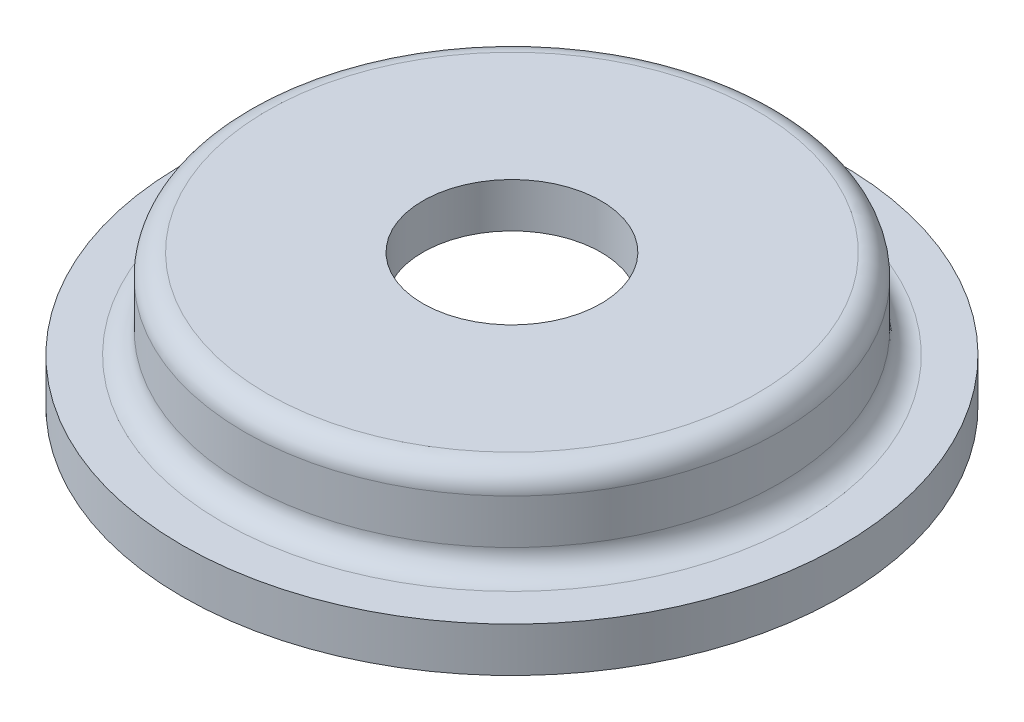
ISO-10303-21;
HEADER;
FILE_DESCRIPTION(('STEP AP214'),'2;1');
FILE_NAME('part.step','',(''),(''),'','','');
FILE_SCHEMA(('AUTOMOTIVE_DESIGN { 1 0 10303 214 1 1 1 1 }'));
ENDSEC;
DATA;
#1=APPLICATION_CONTEXT('core data for automotive mechanical design processes');
#2=APPLICATION_PROTOCOL_DEFINITION('international standard','automotive_design',2000,#1);
#3=PRODUCT_CONTEXT('',#1,'mechanical');
#4=PRODUCT('Part','Part','',(#3));
#5=PRODUCT_RELATED_PRODUCT_CATEGORY('part','',(#4));
#6=PRODUCT_DEFINITION_FORMATION('','',#4);
#7=PRODUCT_DEFINITION_CONTEXT('part definition',#1,'design');
#8=PRODUCT_DEFINITION('design','',#6,#7);
#9=PRODUCT_DEFINITION_SHAPE('','',#8);
#10=(LENGTH_UNIT() NAMED_UNIT(*) SI_UNIT(.MILLI.,.METRE.));
#11=(NAMED_UNIT(*) PLANE_ANGLE_UNIT() SI_UNIT($,.RADIAN.));
#12=(NAMED_UNIT(*) SI_UNIT($,.STERADIAN.) SOLID_ANGLE_UNIT());
#13=UNCERTAINTY_MEASURE_WITH_UNIT(LENGTH_MEASURE(1.E-05),#10,'distance_accuracy_value','');
#14=(GEOMETRIC_REPRESENTATION_CONTEXT(3) GLOBAL_UNCERTAINTY_ASSIGNED_CONTEXT((#13)) GLOBAL_UNIT_ASSIGNED_CONTEXT((#10,
#11,#12)) REPRESENTATION_CONTEXT('',''));
#15=CARTESIAN_POINT('',(0.,0.,0.));
#16=DIRECTION('',(0.,0.,1.));
#17=DIRECTION('',(1.,0.,0.));
#18=AXIS2_PLACEMENT_3D('',#15,#16,#17);
#19=CARTESIAN_POINT('',(-7.4,0.,0.));
#20=DIRECTION('',(0.,-1.,0.));
#21=DIRECTION('',(0.,0.,-1.));
#22=AXIS2_PLACEMENT_3D('',#19,#20,#21);
#23=PLANE('',#22);
#24=CARTESIAN_POINT('',(0.,0.,0.));
#25=DIRECTION('',(0.,1.,0.));
#26=DIRECTION('',(0.,0.,1.));
#27=AXIS2_PLACEMENT_3D('',#24,#25,#26);
#28=CIRCLE('',#27,5.5);
#29=CARTESIAN_POINT('',(0.,0.,5.5));
#30=VERTEX_POINT('',#29);
#31=EDGE_CURVE('E10',#30,#30,#28,.T.);
#32=ORIENTED_EDGE('',*,*,#31,.T.);
#33=EDGE_LOOP('',(#32));
#34=FACE_BOUND('',#33,.T.);
#35=CARTESIAN_POINT('',(0.,0.,0.));
#36=DIRECTION('',(0.,1.,0.));
#37=DIRECTION('',(0.,0.,1.));
#38=AXIS2_PLACEMENT_3D('',#35,#36,#37);
#39=CIRCLE('',#38,7.4);
#40=CARTESIAN_POINT('',(0.,0.,7.4));
#41=VERTEX_POINT('',#40);
#42=EDGE_CURVE('E71',#41,#41,#39,.T.);
#43=ORIENTED_EDGE('',*,*,#42,.F.);
#44=EDGE_LOOP('',(#43));
#45=FACE_BOUND('',#44,.T.);
#46=ADVANCED_FACE('F31',(#34,#45),#23,.T.);
#47=CARTESIAN_POINT('',(0.,0.500000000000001,0.));
#48=DIRECTION('',(0.,1.,0.));
#49=DIRECTION('',(0.,0.,1.));
#50=AXIS2_PLACEMENT_3D('',#47,#48,#49);
#51=TOROIDAL_SURFACE('',#50,5.5,0.5);
#52=CARTESIAN_POINT('',(0.,0.500000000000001,0.));
#53=DIRECTION('',(0.,1.,0.));
#54=DIRECTION('',(0.,0.,1.));
#55=AXIS2_PLACEMENT_3D('',#52,#53,#54);
#56=CIRCLE('',#55,5.);
#57=CARTESIAN_POINT('',(0.,0.500000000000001,5.));
#58=VERTEX_POINT('',#57);
#59=EDGE_CURVE('E37',#58,#58,#56,.T.);
#60=ORIENTED_EDGE('',*,*,#59,.T.);
#61=EDGE_LOOP('',(#60));
#62=FACE_BOUND('',#61,.T.);
#63=ORIENTED_EDGE('',*,*,#31,.F.);
#64=EDGE_LOOP('',(#63));
#65=FACE_BOUND('',#64,.T.);
#66=ADVANCED_FACE('F79',(#62,#65),#51,.T.);
#67=CARTESIAN_POINT('',(0.,7.14478932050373,0.));
#68=DIRECTION('',(0.,1.,0.));
#69=DIRECTION('',(0.,0.,1.));
#70=AXIS2_PLACEMENT_3D('',#67,#68,#69);
#71=CYLINDRICAL_SURFACE('',#70,5.);
#72=CARTESIAN_POINT('',(0.,1.5,0.));
#73=DIRECTION('',(0.,1.,0.));
#74=DIRECTION('',(0.,0.,1.));
#75=AXIS2_PLACEMENT_3D('',#72,#73,#74);
#76=CIRCLE('',#75,5.);
#77=CARTESIAN_POINT('',(0.,1.5,5.));
#78=VERTEX_POINT('',#77);
#79=EDGE_CURVE('E41',#78,#78,#76,.T.);
#80=ORIENTED_EDGE('',*,*,#79,.T.);
#81=EDGE_LOOP('',(#80));
#82=FACE_BOUND('',#81,.T.);
#83=ORIENTED_EDGE('',*,*,#59,.F.);
#84=EDGE_LOOP('',(#83));
#85=FACE_BOUND('',#84,.T.);
#86=ADVANCED_FACE('F83',(#82,#85),#71,.F.);
#87=CARTESIAN_POINT('',(0.,1.5,0.));
#88=DIRECTION('',(0.,1.,0.));
#89=DIRECTION('',(0.,0.,1.));
#90=AXIS2_PLACEMENT_3D('',#87,#88,#89);
#91=TOROIDAL_SURFACE('',#90,4.5,0.5);
#92=CARTESIAN_POINT('',(0.,2.,0.));
#93=DIRECTION('',(0.,1.,0.));
#94=DIRECTION('',(0.,0.,1.));
#95=AXIS2_PLACEMENT_3D('',#92,#93,#94);
#96=CIRCLE('',#95,4.5);
#97=CARTESIAN_POINT('',(0.,2.,4.5));
#98=VERTEX_POINT('',#97);
#99=EDGE_CURVE('E45',#98,#98,#96,.T.);
#100=ORIENTED_EDGE('',*,*,#99,.T.);
#101=EDGE_LOOP('',(#100));
#102=FACE_BOUND('',#101,.T.);
#103=ORIENTED_EDGE('',*,*,#79,.F.);
#104=EDGE_LOOP('',(#103));
#105=FACE_BOUND('',#104,.T.);
#106=ADVANCED_FACE('F87',(#102,#105),#91,.F.);
#107=CARTESIAN_POINT('',(-4.5,2.,0.));
#108=DIRECTION('',(0.,-1.,0.));
#109=DIRECTION('',(0.,0.,-1.));
#110=AXIS2_PLACEMENT_3D('',#107,#108,#109);
#111=PLANE('',#110);
#112=CARTESIAN_POINT('',(0.,2.,0.));
#113=DIRECTION('',(0.,1.,0.));
#114=DIRECTION('',(0.,0.,1.));
#115=AXIS2_PLACEMENT_3D('',#112,#113,#114);
#116=CIRCLE('',#115,2.);
#117=CARTESIAN_POINT('',(0.,2.,2.));
#118=VERTEX_POINT('',#117);
#119=EDGE_CURVE('E50',#118,#118,#116,.T.);
#120=ORIENTED_EDGE('',*,*,#119,.T.);
#121=EDGE_LOOP('',(#120));
#122=FACE_BOUND('',#121,.T.);
#123=ORIENTED_EDGE('',*,*,#99,.F.);
#124=EDGE_LOOP('',(#123));
#125=FACE_BOUND('',#124,.T.);
#126=ADVANCED_FACE('F94',(#122,#125),#111,.T.);
#127=CARTESIAN_POINT('',(0.,7.14478932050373,0.));
#128=DIRECTION('',(0.,1.,0.));
#129=DIRECTION('',(0.,0.,1.));
#130=AXIS2_PLACEMENT_3D('',#127,#128,#129);
#131=CYLINDRICAL_SURFACE('',#130,2.);
#132=CARTESIAN_POINT('',(0.,3.,0.));
#133=DIRECTION('',(0.,1.,0.));
#134=DIRECTION('',(0.,0.,1.));
#135=AXIS2_PLACEMENT_3D('',#132,#133,#134);
#136=CIRCLE('',#135,2.);
#137=CARTESIAN_POINT('',(0.,3.,2.));
#138=VERTEX_POINT('',#137);
#139=EDGE_CURVE('E53',#138,#138,#136,.T.);
#140=ORIENTED_EDGE('',*,*,#139,.T.);
#141=EDGE_LOOP('',(#140));
#142=FACE_BOUND('',#141,.T.);
#143=ORIENTED_EDGE('',*,*,#119,.F.);
#144=EDGE_LOOP('',(#143));
#145=FACE_BOUND('',#144,.T.);
#146=ADVANCED_FACE('F98',(#142,#145),#131,.F.);
#147=CARTESIAN_POINT('',(-5.5,3.,0.));
#148=DIRECTION('',(0.,1.,0.));
#149=DIRECTION('',(0.,0.,1.));
#150=AXIS2_PLACEMENT_3D('',#147,#148,#149);
#151=PLANE('',#150);
#152=CARTESIAN_POINT('',(0.,3.,0.));
#153=DIRECTION('',(0.,1.,0.));
#154=DIRECTION('',(0.,0.,1.));
#155=AXIS2_PLACEMENT_3D('',#152,#153,#154);
#156=CIRCLE('',#155,5.5);
#157=CARTESIAN_POINT('',(0.,3.,5.5));
#158=VERTEX_POINT('',#157);
#159=EDGE_CURVE('E56',#158,#158,#156,.T.);
#160=ORIENTED_EDGE('',*,*,#159,.T.);
#161=EDGE_LOOP('',(#160));
#162=FACE_BOUND('',#161,.T.);
#163=ORIENTED_EDGE('',*,*,#139,.F.);
#164=EDGE_LOOP('',(#163));
#165=FACE_BOUND('',#164,.T.);
#166=ADVANCED_FACE('F102',(#162,#165),#151,.T.);
#167=CARTESIAN_POINT('',(0.,2.5,0.));
#168=DIRECTION('',(0.,1.,0.));
#169=DIRECTION('',(0.,0.,1.));
#170=AXIS2_PLACEMENT_3D('',#167,#168,#169);
#171=TOROIDAL_SURFACE('',#170,5.5,0.5);
#172=CARTESIAN_POINT('',(0.,2.5,0.));
#173=DIRECTION('',(0.,1.,0.));
#174=DIRECTION('',(0.,0.,1.));
#175=AXIS2_PLACEMENT_3D('',#172,#173,#174);
#176=CIRCLE('',#175,6.);
#177=CARTESIAN_POINT('',(0.,2.5,6.));
#178=VERTEX_POINT('',#177);
#179=EDGE_CURVE('E59',#178,#178,#176,.T.);
#180=ORIENTED_EDGE('',*,*,#179,.T.);
#181=EDGE_LOOP('',(#180));
#182=FACE_BOUND('',#181,.T.);
#183=ORIENTED_EDGE('',*,*,#159,.F.);
#184=EDGE_LOOP('',(#183));
#185=FACE_BOUND('',#184,.T.);
#186=ADVANCED_FACE('F106',(#182,#185),#171,.T.);
#187=CARTESIAN_POINT('',(0.,7.14478932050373,0.));
#188=DIRECTION('',(0.,1.,0.));
#189=DIRECTION('',(0.,0.,1.));
#190=AXIS2_PLACEMENT_3D('',#187,#188,#189);
#191=CYLINDRICAL_SURFACE('',#190,6.);
#192=CARTESIAN_POINT('',(0.,1.5,0.));
#193=DIRECTION('',(0.,1.,0.));
#194=DIRECTION('',(0.,0.,1.));
#195=AXIS2_PLACEMENT_3D('',#192,#193,#194);
#196=CIRCLE('',#195,6.);
#197=CARTESIAN_POINT('',(0.,1.5,6.));
#198=VERTEX_POINT('',#197);
#199=EDGE_CURVE('E62',#198,#198,#196,.T.);
#200=ORIENTED_EDGE('',*,*,#199,.T.);
#201=EDGE_LOOP('',(#200));
#202=FACE_BOUND('',#201,.T.);
#203=ORIENTED_EDGE('',*,*,#179,.F.);
#204=EDGE_LOOP('',(#203));
#205=FACE_BOUND('',#204,.T.);
#206=ADVANCED_FACE('F110',(#202,#205),#191,.T.);
#207=CARTESIAN_POINT('',(0.,1.5,0.));
#208=DIRECTION('',(0.,1.,0.));
#209=DIRECTION('',(0.,0.,1.));
#210=AXIS2_PLACEMENT_3D('',#207,#208,#209);
#211=TOROIDAL_SURFACE('',#210,6.5,0.5);
#212=CARTESIAN_POINT('',(0.,1.,0.));
#213=DIRECTION('',(0.,1.,0.));
#214=DIRECTION('',(0.,0.,1.));
#215=AXIS2_PLACEMENT_3D('',#212,#213,#214);
#216=CIRCLE('',#215,6.5);
#217=CARTESIAN_POINT('',(0.,1.,6.5));
#218=VERTEX_POINT('',#217);
#219=EDGE_CURVE('E65',#218,#218,#216,.T.);
#220=ORIENTED_EDGE('',*,*,#219,.T.);
#221=EDGE_LOOP('',(#220));
#222=FACE_BOUND('',#221,.T.);
#223=ORIENTED_EDGE('',*,*,#199,.F.);
#224=EDGE_LOOP('',(#223));
#225=FACE_BOUND('',#224,.T.);
#226=ADVANCED_FACE('F114',(#222,#225),#211,.F.);
#227=CARTESIAN_POINT('',(-7.4,1.,0.));
#228=DIRECTION('',(0.,1.,0.));
#229=DIRECTION('',(0.,0.,1.));
#230=AXIS2_PLACEMENT_3D('',#227,#228,#229);
#231=PLANE('',#230);
#232=CARTESIAN_POINT('',(0.,1.,0.));
#233=DIRECTION('',(0.,1.,0.));
#234=DIRECTION('',(0.,0.,1.));
#235=AXIS2_PLACEMENT_3D('',#232,#233,#234);
#236=CIRCLE('',#235,7.4);
#237=CARTESIAN_POINT('',(0.,1.,7.4));
#238=VERTEX_POINT('',#237);
#239=EDGE_CURVE('E68',#238,#238,#236,.T.);
#240=ORIENTED_EDGE('',*,*,#239,.T.);
#241=EDGE_LOOP('',(#240));
#242=FACE_BOUND('',#241,.T.);
#243=ORIENTED_EDGE('',*,*,#219,.F.);
#244=EDGE_LOOP('',(#243));
#245=FACE_BOUND('',#244,.T.);
#246=ADVANCED_FACE('F118',(#242,#245),#231,.T.);
#247=CARTESIAN_POINT('',(0.,7.14478932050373,0.));
#248=DIRECTION('',(0.,1.,0.));
#249=DIRECTION('',(0.,0.,1.));
#250=AXIS2_PLACEMENT_3D('',#247,#248,#249);
#251=CYLINDRICAL_SURFACE('',#250,7.4);
#252=ORIENTED_EDGE('',*,*,#42,.T.);
#253=EDGE_LOOP('',(#252));
#254=FACE_BOUND('',#253,.T.);
#255=ORIENTED_EDGE('',*,*,#239,.F.);
#256=EDGE_LOOP('',(#255));
#257=FACE_BOUND('',#256,.T.);
#258=ADVANCED_FACE('F75',(#254,#257),#251,.T.);
#259=CLOSED_SHELL('',(#46,#66,#86,#106,#126,#146,#166,#186,#206,#226,#246,#258));
#260=MANIFOLD_SOLID_BREP('B2',#259);
#261=ADVANCED_BREP_SHAPE_REPRESENTATION('',(#18,#260),#14);
#262=SHAPE_DEFINITION_REPRESENTATION(#9,#261);
ENDSEC;
END-ISO-10303-21;
